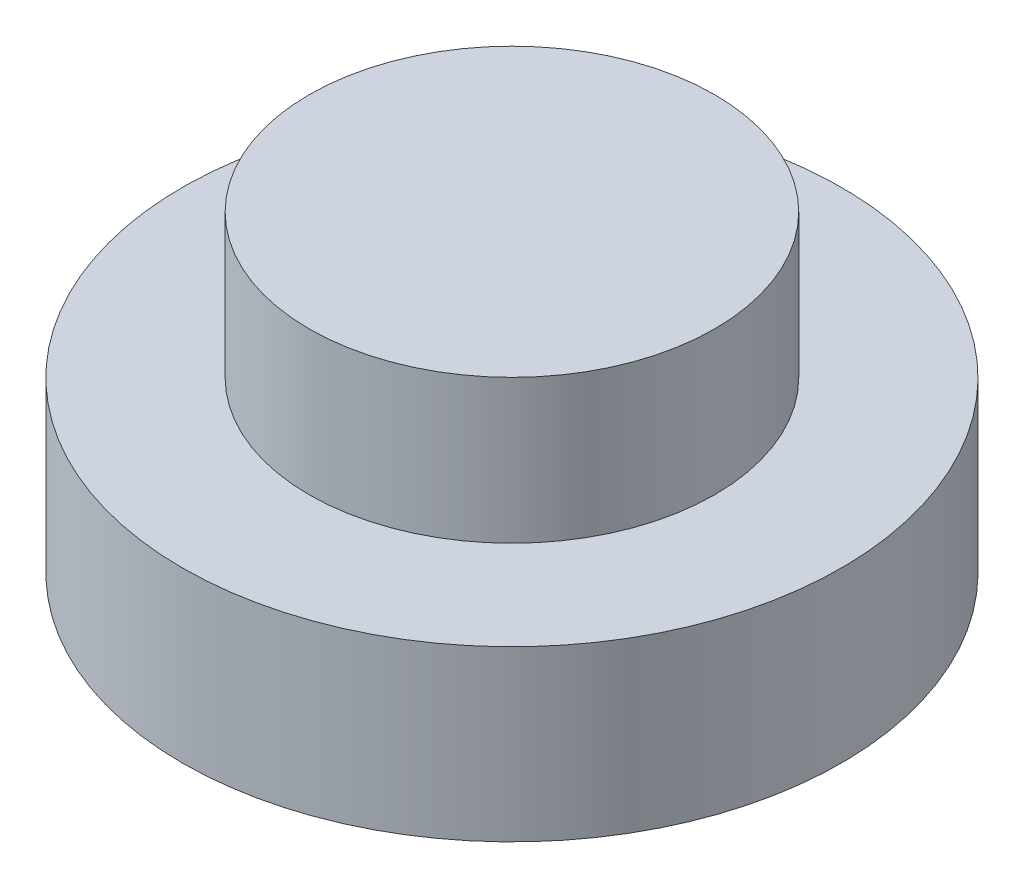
ISO-10303-21;
HEADER;
FILE_DESCRIPTION(('STEP AP214'),'2;1');
FILE_NAME('part.step','',(''),(''),'','','');
FILE_SCHEMA(('AUTOMOTIVE_DESIGN { 1 0 10303 214 1 1 1 1 }'));
ENDSEC;
DATA;
#1=APPLICATION_CONTEXT('core data for automotive mechanical design processes');
#2=APPLICATION_PROTOCOL_DEFINITION('international standard','automotive_design',2000,#1);
#3=PRODUCT_CONTEXT('',#1,'mechanical');
#4=PRODUCT('Part','Part','',(#3));
#5=PRODUCT_RELATED_PRODUCT_CATEGORY('part','',(#4));
#6=PRODUCT_DEFINITION_FORMATION('','',#4);
#7=PRODUCT_DEFINITION_CONTEXT('part definition',#1,'design');
#8=PRODUCT_DEFINITION('design','',#6,#7);
#9=PRODUCT_DEFINITION_SHAPE('','',#8);
#10=(LENGTH_UNIT() NAMED_UNIT(*) SI_UNIT(.MILLI.,.METRE.));
#11=(NAMED_UNIT(*) PLANE_ANGLE_UNIT() SI_UNIT($,.RADIAN.));
#12=(NAMED_UNIT(*) SI_UNIT($,.STERADIAN.) SOLID_ANGLE_UNIT());
#13=UNCERTAINTY_MEASURE_WITH_UNIT(LENGTH_MEASURE(1.E-05),#10,'distance_accuracy_value','');
#14=(GEOMETRIC_REPRESENTATION_CONTEXT(3) GLOBAL_UNCERTAINTY_ASSIGNED_CONTEXT((#13)) GLOBAL_UNIT_ASSIGNED_CONTEXT((#10,
#11,#12)) REPRESENTATION_CONTEXT('',''));
#15=CARTESIAN_POINT('',(0.,0.,0.));
#16=DIRECTION('',(0.,0.,1.));
#17=DIRECTION('',(1.,0.,0.));
#18=AXIS2_PLACEMENT_3D('',#15,#16,#17);
#19=CARTESIAN_POINT('',(0.,2.,0.));
#20=DIRECTION('',(0.,1.,0.));
#21=DIRECTION('',(0.,0.,1.));
#22=AXIS2_PLACEMENT_3D('',#19,#20,#21);
#23=PLANE('',#22);
#24=CARTESIAN_POINT('',(0.,2.,0.));
#25=DIRECTION('',(0.,1.,0.));
#26=DIRECTION('',(0.,0.,1.));
#27=AXIS2_PLACEMENT_3D('',#24,#25,#26);
#28=CIRCLE('',#27,3.9);
#29=CARTESIAN_POINT('',(0.,2.,3.9));
#30=VERTEX_POINT('',#29);
#31=EDGE_CURVE('E10',#30,#30,#28,.T.);
#32=ORIENTED_EDGE('',*,*,#31,.T.);
#33=EDGE_LOOP('',(#32));
#34=FACE_BOUND('',#33,.T.);
#35=CARTESIAN_POINT('',(0.,2.,0.));
#36=DIRECTION('',(0.,1.,0.));
#37=DIRECTION('',(0.,0.,1.));
#38=AXIS2_PLACEMENT_3D('',#35,#36,#37);
#39=CIRCLE('',#38,2.4);
#40=CARTESIAN_POINT('',(0.,2.,2.4));
#41=VERTEX_POINT('',#40);
#42=EDGE_CURVE('E47',#41,#41,#39,.T.);
#43=ORIENTED_EDGE('',*,*,#42,.F.);
#44=EDGE_LOOP('',(#43));
#45=FACE_BOUND('',#44,.T.);
#46=ADVANCED_FACE('F34',(#34,#45),#23,.T.);
#47=CARTESIAN_POINT('',(0.,2.,0.));
#48=DIRECTION('',(0.,-1.,0.));
#49=DIRECTION('',(0.,0.,-1.));
#50=AXIS2_PLACEMENT_3D('',#47,#48,#49);
#51=CYLINDRICAL_SURFACE('',#50,3.9);
#52=ORIENTED_EDGE('',*,*,#31,.F.);
#53=EDGE_LOOP('',(#52));
#54=FACE_BOUND('',#53,.T.);
#55=CARTESIAN_POINT('',(0.,0.,0.));
#56=DIRECTION('',(0.,1.,0.));
#57=DIRECTION('',(0.,0.,1.));
#58=AXIS2_PLACEMENT_3D('',#55,#56,#57);
#59=CIRCLE('',#58,3.9);
#60=CARTESIAN_POINT('',(0.,0.,3.9));
#61=VERTEX_POINT('',#60);
#62=EDGE_CURVE('E38',#61,#61,#59,.T.);
#63=ORIENTED_EDGE('',*,*,#62,.T.);
#64=EDGE_LOOP('',(#63));
#65=FACE_BOUND('',#64,.T.);
#66=ADVANCED_FACE('F36',(#54,#65),#51,.T.);
#67=CARTESIAN_POINT('',(0.,0.,0.));
#68=DIRECTION('',(0.,1.,0.));
#69=DIRECTION('',(0.,0.,1.));
#70=AXIS2_PLACEMENT_3D('',#67,#68,#69);
#71=PLANE('',#70);
#72=CARTESIAN_POINT('',(0.,0.,0.));
#73=DIRECTION('',(0.,-1.,0.));
#74=DIRECTION('',(0.,0.,-1.));
#75=AXIS2_PLACEMENT_3D('',#72,#73,#74);
#76=CIRCLE('',#75,2.4);
#77=CARTESIAN_POINT('',(0.,0.,-2.4));
#78=VERTEX_POINT('',#77);
#79=EDGE_CURVE('E53',#78,#78,#76,.T.);
#80=ORIENTED_EDGE('',*,*,#79,.F.);
#81=EDGE_LOOP('',(#80));
#82=FACE_BOUND('',#81,.T.);
#83=ORIENTED_EDGE('',*,*,#62,.F.);
#84=EDGE_LOOP('',(#83));
#85=FACE_BOUND('',#84,.T.);
#86=ADVANCED_FACE('F68',(#82,#85),#71,.F.);
#87=CARTESIAN_POINT('',(0.,3.7,0.));
#88=DIRECTION('',(0.,-1.,0.));
#89=DIRECTION('',(0.,0.,-1.));
#90=AXIS2_PLACEMENT_3D('',#87,#88,#89);
#91=CYLINDRICAL_SURFACE('',#90,2.4);
#92=CARTESIAN_POINT('',(0.,3.7,0.));
#93=DIRECTION('',(0.,1.,0.));
#94=DIRECTION('',(0.,0.,1.));
#95=AXIS2_PLACEMENT_3D('',#92,#93,#94);
#96=CIRCLE('',#95,2.4);
#97=CARTESIAN_POINT('',(0.,3.7,2.4));
#98=VERTEX_POINT('',#97);
#99=EDGE_CURVE('E45',#98,#98,#96,.T.);
#100=ORIENTED_EDGE('',*,*,#99,.F.);
#101=EDGE_LOOP('',(#100));
#102=FACE_BOUND('',#101,.T.);
#103=ORIENTED_EDGE('',*,*,#42,.T.);
#104=EDGE_LOOP('',(#103));
#105=FACE_BOUND('',#104,.T.);
#106=ADVANCED_FACE('F71',(#102,#105),#91,.T.);
#107=CARTESIAN_POINT('',(0.,3.7,0.));
#108=DIRECTION('',(0.,1.,0.));
#109=DIRECTION('',(0.,0.,1.));
#110=AXIS2_PLACEMENT_3D('',#107,#108,#109);
#111=PLANE('',#110);
#112=ORIENTED_EDGE('',*,*,#99,.T.);
#113=EDGE_LOOP('',(#112));
#114=FACE_BOUND('',#113,.T.);
#115=ADVANCED_FACE('F64',(#114),#111,.T.);
#116=CARTESIAN_POINT('',(0.,1.7,0.));
#117=DIRECTION('',(0.,-1.,0.));
#118=DIRECTION('',(0.,0.,-1.));
#119=AXIS2_PLACEMENT_3D('',#116,#117,#118);
#120=CYLINDRICAL_SURFACE('',#119,2.4);
#121=CARTESIAN_POINT('',(0.,1.7,0.));
#122=DIRECTION('',(0.,-1.,0.));
#123=DIRECTION('',(0.,0.,-1.));
#124=AXIS2_PLACEMENT_3D('',#121,#122,#123);
#125=CIRCLE('',#124,2.4);
#126=CARTESIAN_POINT('',(0.,1.7,-2.4));
#127=VERTEX_POINT('',#126);
#128=EDGE_CURVE('E50',#127,#127,#125,.T.);
#129=ORIENTED_EDGE('',*,*,#128,.F.);
#130=EDGE_LOOP('',(#129));
#131=FACE_BOUND('',#130,.T.);
#132=ORIENTED_EDGE('',*,*,#79,.T.);
#133=EDGE_LOOP('',(#132));
#134=FACE_BOUND('',#133,.T.);
#135=ADVANCED_FACE('F61',(#131,#134),#120,.F.);
#136=CARTESIAN_POINT('',(0.,1.7,0.));
#137=DIRECTION('',(0.,-1.,0.));
#138=DIRECTION('',(0.,0.,-1.));
#139=AXIS2_PLACEMENT_3D('',#136,#137,#138);
#140=PLANE('',#139);
#141=ORIENTED_EDGE('',*,*,#128,.T.);
#142=EDGE_LOOP('',(#141));
#143=FACE_BOUND('',#142,.T.);
#144=ADVANCED_FACE('F59',(#143),#140,.T.);
#145=CLOSED_SHELL('',(#46,#66,#86,#106,#115,#135,#144));
#146=MANIFOLD_SOLID_BREP('B2',#145);
#147=ADVANCED_BREP_SHAPE_REPRESENTATION('',(#18,#146),#14);
#148=SHAPE_DEFINITION_REPRESENTATION(#9,#147);
ENDSEC;
END-ISO-10303-21;
